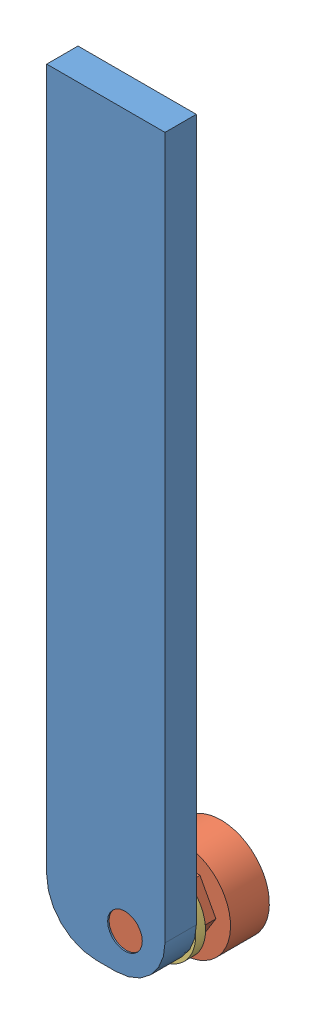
SolidWorks assembly wheel_assembly.SLDASM, configuration Default (file format 6000). Lengths in mm.
Overall size (29.15 157.68 19.48).
3 component instances, 3 part files, 4 mates.
Components (placement in the parent):
- wheel_mount-1: wheel_mount.SLDPRT [Default] at origin size (24 152.4 6.35)
- wheel-1: wheel.SLDPRT [Default] at (0 0 -13.13) x (0.473152 -0.880981 0) z (0 0 1) size (19.61 19.61 19.19)
- wheel_washer-1: wheel_washer.SLDPRT [Default] x (-0.976712 0.214557 0) z (0 0 -1) size (16 16 2)
Mates (geometry in assembly coordinates):
- Concentric2: concentric anti-aligned: cylinder of wheel-1 through (0 0 6.06) axis (0 0 -1) radius 3.915; cylinder of wheel_washer-1 through (0 0 -2) axis (0 0 1) radius 4
- Coincident1: coincident anti-aligned: plane of wheel-1 through (0 0 -2) normal (0 0 1); plane of wheel_washer-1 through (0 0 -2) normal (0 0 -1)
- Concentric3: concentric aligned: cylinder of wheel_mount-1 through (0 0 6.35) axis (0 0 -1) radius 3.5179; cylinder of wheel-1 through (0 0 6.06) axis (0 0 -1) radius 3.915
- Coincident3: coincident anti-aligned: plane of wheel_mount-1 through (0 0 0) normal (0 0 -1); plane of wheel_washer-1 through (0 0 0) normal (0 0 1)
